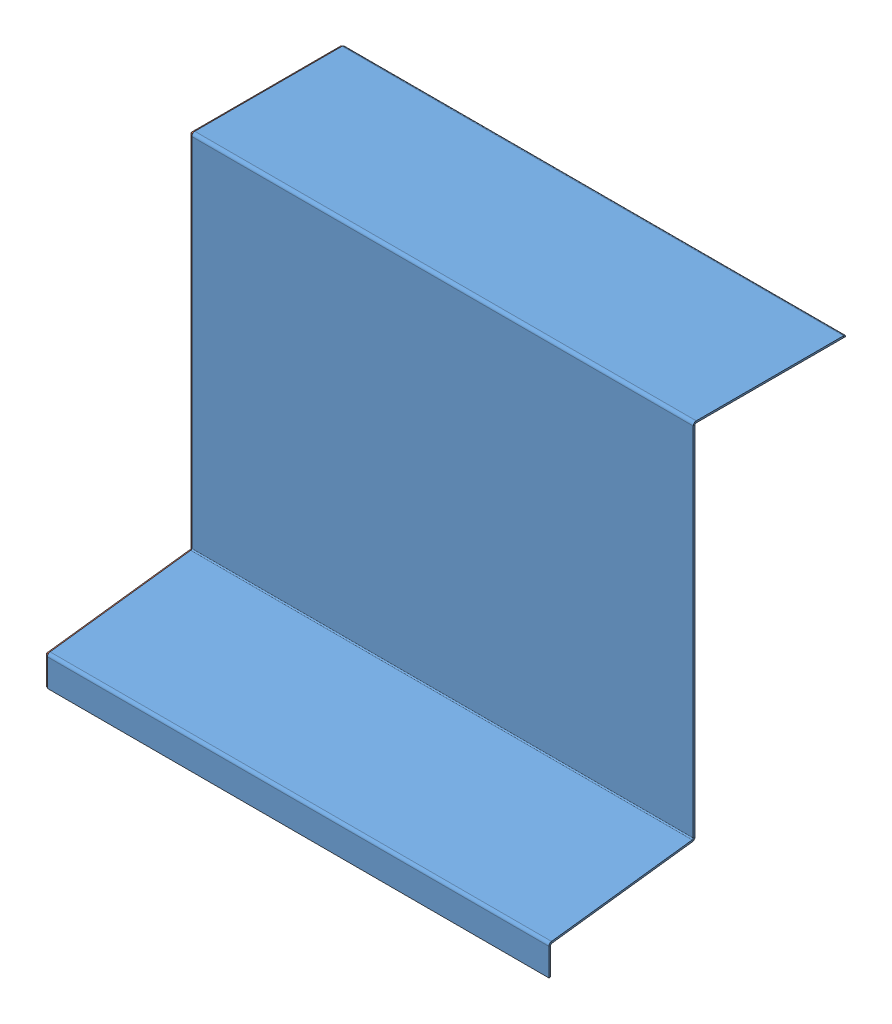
SolidWorks assembly Baugruppe1.sldasm, configuration Standard (file format 4400). Lengths in mm.
Overall size (418.65 340.15 247.5).
2 component instances, 2 part files, 3 mates.
Components (placement in the parent):
- Teil1-1: Teil1.SLDPRT [Standard] at (2.6103 -94.7339 3.75) size (417.3 340 247.5)
- Teil2-1: Teil2.SLDPRT [Standard] at (-205.8897 -134.7339 123.75) size (33.5 339.55 246.75)
Mates (geometry in assembly coordinates):
- Deckungsgleich1: coincident anti-aligned: plane of Teil1-1 through (-205.8897 -111.9409 121.25) normal (-1 0 0); plane of Teil2-1 through (-205.8897 -134.7339 123) normal (1 0 0)
- Abstand2: distance = 0.75 mm aligned: plane of Teil2-1 through (-207.3897 204.5161 3) normal (0 1 0); plane of Teil1-1 through (211.1103 205.2661 3.75) normal (0 1 0)
- Deckungsgleich9: coincident aligned: plane of Teil1-1 through (211.1103 203.7661 -123.75) normal (0 0 -1); plane of Teil2-1 through (-205.8897 204.5161 -123.75) normal (0 0 -1)
